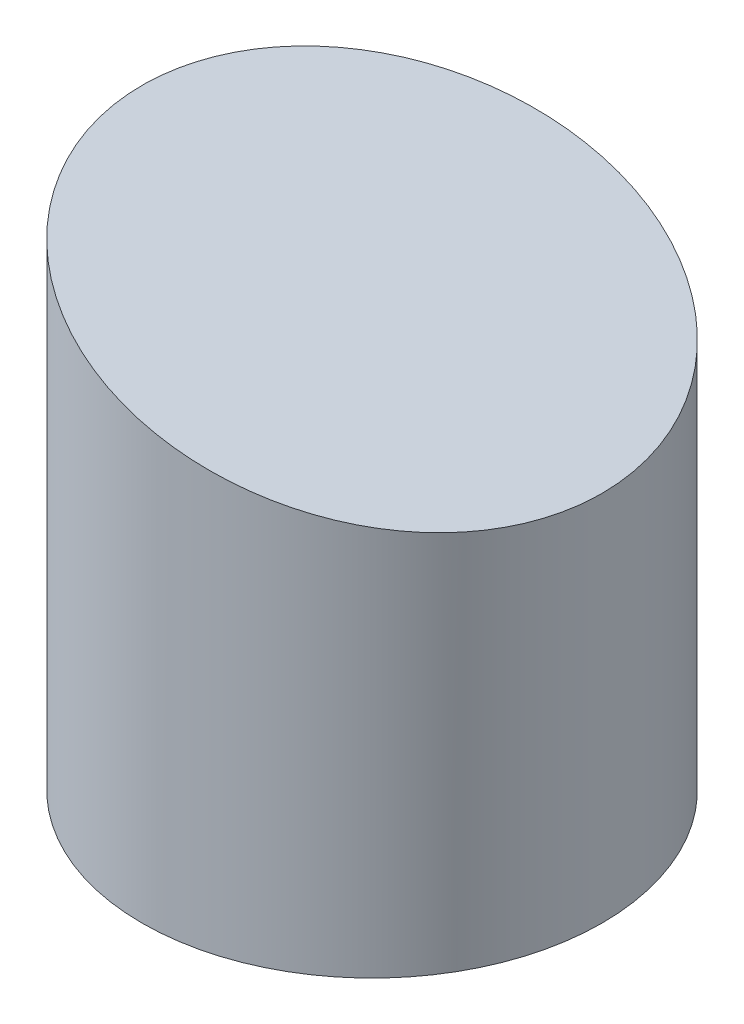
from build123d import *

# Parameters (mm, degrees)
SKETCH1_R               = 32.5
BOSS_EXTRUDE1_DEPTH     = 35
CUT_EXTRUDE1_DEPTH      = 58.771100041
CUT_EXTRUDE1_DEPTH_BACK = 58.771100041


with BuildPart() as part:
    # Sketch1 → Boss-Extrude1 (new, symmetric)
    with BuildSketch(Plane(origin=(0, 0, 0), x_dir=(1, 0, 0), z_dir=(0, 1, 0))):
        with Locations(Location((0, 0, 0), (0, 0, 270))):
            Circle(SKETCH1_R)
    extrude(amount=BOSS_EXTRUDE1_DEPTH, both=True)

    # Sketch2 → Cut-Extrude1 (cut, two sides: drawn at the far end of the back side and taken through both)
    with BuildSketch(Plane.XY.offset(-CUT_EXTRUDE1_DEPTH_BACK)):
        Polygon((-226.699128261, 87.035499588), (-32.5, 35), (32.5, 17.583302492), (226.699128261, -34.452197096), (330.770127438, 353.946059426), (-122.628129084, 475.433756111), align=None)
    extrude(amount=CUT_EXTRUDE1_DEPTH + CUT_EXTRUDE1_DEPTH_BACK, mode=Mode.SUBTRACT)


solid = part.part
